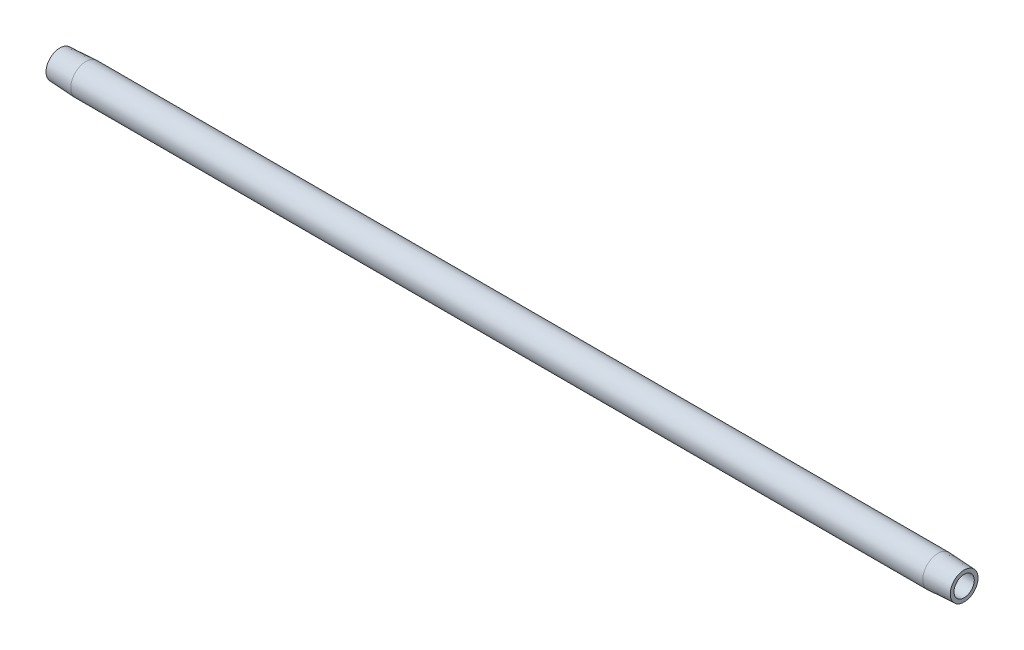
ISO-10303-21;
HEADER;
FILE_DESCRIPTION(('STEP AP214'),'2;1');
FILE_NAME('part.step','',(''),(''),'','','');
FILE_SCHEMA(('AUTOMOTIVE_DESIGN { 1 0 10303 214 1 1 1 1 }'));
ENDSEC;
DATA;
#1=APPLICATION_CONTEXT('core data for automotive mechanical design processes');
#2=APPLICATION_PROTOCOL_DEFINITION('international standard','automotive_design',2000,#1);
#3=PRODUCT_CONTEXT('',#1,'mechanical');
#4=PRODUCT('Part','Part','',(#3));
#5=PRODUCT_RELATED_PRODUCT_CATEGORY('part','',(#4));
#6=PRODUCT_DEFINITION_FORMATION('','',#4);
#7=PRODUCT_DEFINITION_CONTEXT('part definition',#1,'design');
#8=PRODUCT_DEFINITION('design','',#6,#7);
#9=PRODUCT_DEFINITION_SHAPE('','',#8);
#10=(LENGTH_UNIT() NAMED_UNIT(*) SI_UNIT(.MILLI.,.METRE.));
#11=(NAMED_UNIT(*) PLANE_ANGLE_UNIT() SI_UNIT($,.RADIAN.));
#12=(NAMED_UNIT(*) SI_UNIT($,.STERADIAN.) SOLID_ANGLE_UNIT());
#13=UNCERTAINTY_MEASURE_WITH_UNIT(LENGTH_MEASURE(1.E-05),#10,'distance_accuracy_value','');
#14=(GEOMETRIC_REPRESENTATION_CONTEXT(3) GLOBAL_UNCERTAINTY_ASSIGNED_CONTEXT((#13)) GLOBAL_UNIT_ASSIGNED_CONTEXT((#10,
#11,#12)) REPRESENTATION_CONTEXT('',''));
#15=CARTESIAN_POINT('',(0.,0.,0.));
#16=DIRECTION('',(0.,0.,1.));
#17=DIRECTION('',(1.,0.,0.));
#18=AXIS2_PLACEMENT_3D('',#15,#16,#17);
#19=CARTESIAN_POINT('',(0.476141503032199,0.,0.));
#20=DIRECTION('',(-1.,0.,0.));
#21=DIRECTION('',(0.,0.,1.));
#22=AXIS2_PLACEMENT_3D('',#19,#20,#21);
#23=CYLINDRICAL_SURFACE('',#22,5.14349999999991);
#24=CARTESIAN_POINT('',(8.8100393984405,0.,0.));
#25=DIRECTION('',(-1.,0.,0.));
#26=DIRECTION('',(0.,0.,1.));
#27=AXIS2_PLACEMENT_3D('',#24,#25,#26);
#28=CIRCLE('',#27,5.14349999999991);
#29=CARTESIAN_POINT('',(8.8100393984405,0.,5.14349999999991));
#30=VERTEX_POINT('',#29);
#31=EDGE_CURVE('E10',#30,#30,#28,.T.);
#32=ORIENTED_EDGE('',*,*,#31,.F.);
#33=EDGE_LOOP('',(#32));
#34=FACE_BOUND('',#33,.T.);
#35=CARTESIAN_POINT('',(295.989960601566,0.,0.));
#36=DIRECTION('',(-1.,0.,0.));
#37=DIRECTION('',(0.,0.,1.));
#38=AXIS2_PLACEMENT_3D('',#35,#36,#37);
#39=CIRCLE('',#38,5.14349999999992);
#40=CARTESIAN_POINT('',(295.989960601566,0.,5.14349999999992));
#41=VERTEX_POINT('',#40);
#42=EDGE_CURVE('E52',#41,#41,#39,.T.);
#43=ORIENTED_EDGE('',*,*,#42,.T.);
#44=EDGE_LOOP('',(#43));
#45=FACE_BOUND('',#44,.T.);
#46=ADVANCED_FACE('F30',(#34,#45),#23,.T.);
#47=CARTESIAN_POINT('',(8.8100393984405,0.,0.));
#48=DIRECTION('',(1.,0.,0.));
#49=DIRECTION('',(0.,0.,-1.));
#50=AXIS2_PLACEMENT_3D('',#47,#48,#49);
#51=CONICAL_SURFACE('',#50,5.14349999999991,0.0523598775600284);
#52=CARTESIAN_POINT('',(0.,0.,0.));
#53=DIRECTION('',(-1.,0.,0.));
#54=DIRECTION('',(0.,0.,1.));
#55=AXIS2_PLACEMENT_3D('',#52,#53,#54);
#56=CIRCLE('',#55,4.68178539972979);
#57=CARTESIAN_POINT('',(0.,0.,4.68178539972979));
#58=VERTEX_POINT('',#57);
#59=EDGE_CURVE('E36',#58,#58,#56,.T.);
#60=ORIENTED_EDGE('',*,*,#59,.F.);
#61=EDGE_LOOP('',(#60));
#62=FACE_BOUND('',#61,.T.);
#63=ORIENTED_EDGE('',*,*,#31,.T.);
#64=EDGE_LOOP('',(#63));
#65=FACE_BOUND('',#64,.T.);
#66=ADVANCED_FACE('F77',(#62,#65),#51,.T.);
#67=CARTESIAN_POINT('',(0.,4.68178539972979,0.));
#68=DIRECTION('',(1.,0.,0.));
#69=DIRECTION('',(0.,0.,-1.));
#70=AXIS2_PLACEMENT_3D('',#67,#68,#69);
#71=PLANE('',#70);
#72=CARTESIAN_POINT('',(0.,0.,0.));
#73=DIRECTION('',(-1.,0.,0.));
#74=DIRECTION('',(0.,0.,1.));
#75=AXIS2_PLACEMENT_3D('',#72,#73,#74);
#76=CIRCLE('',#75,3.4163);
#77=CARTESIAN_POINT('',(0.,0.,3.4163));
#78=VERTEX_POINT('',#77);
#79=EDGE_CURVE('E40',#78,#78,#76,.T.);
#80=ORIENTED_EDGE('',*,*,#79,.F.);
#81=EDGE_LOOP('',(#80));
#82=FACE_BOUND('',#81,.T.);
#83=ORIENTED_EDGE('',*,*,#59,.T.);
#84=EDGE_LOOP('',(#83));
#85=FACE_BOUND('',#84,.T.);
#86=ADVANCED_FACE('F72',(#82,#85),#71,.F.);
#87=CARTESIAN_POINT('',(0.476141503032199,0.,0.));
#88=DIRECTION('',(-1.,0.,0.));
#89=DIRECTION('',(0.,0.,1.));
#90=AXIS2_PLACEMENT_3D('',#87,#88,#89);
#91=CYLINDRICAL_SURFACE('',#90,3.4163);
#92=CARTESIAN_POINT('',(304.8,0.,0.));
#93=DIRECTION('',(-1.,0.,0.));
#94=DIRECTION('',(0.,0.,1.));
#95=AXIS2_PLACEMENT_3D('',#92,#93,#94);
#96=CIRCLE('',#95,3.41630000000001);
#97=CARTESIAN_POINT('',(304.8,0.,3.41630000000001));
#98=VERTEX_POINT('',#97);
#99=EDGE_CURVE('E44',#98,#98,#96,.T.);
#100=ORIENTED_EDGE('',*,*,#99,.F.);
#101=EDGE_LOOP('',(#100));
#102=FACE_BOUND('',#101,.T.);
#103=ORIENTED_EDGE('',*,*,#79,.T.);
#104=EDGE_LOOP('',(#103));
#105=FACE_BOUND('',#104,.T.);
#106=ADVANCED_FACE('F66',(#102,#105),#91,.F.);
#107=CARTESIAN_POINT('',(304.8,3.41630000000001,0.));
#108=DIRECTION('',(-1.,0.,0.));
#109=DIRECTION('',(0.,0.,1.));
#110=AXIS2_PLACEMENT_3D('',#107,#108,#109);
#111=PLANE('',#110);
#112=CARTESIAN_POINT('',(304.8,0.,0.));
#113=DIRECTION('',(-1.,0.,0.));
#114=DIRECTION('',(0.,0.,1.));
#115=AXIS2_PLACEMENT_3D('',#112,#113,#114);
#116=CIRCLE('',#115,4.68178539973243);
#117=CARTESIAN_POINT('',(304.8,0.,4.68178539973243));
#118=VERTEX_POINT('',#117);
#119=EDGE_CURVE('E49',#118,#118,#116,.T.);
#120=ORIENTED_EDGE('',*,*,#119,.F.);
#121=EDGE_LOOP('',(#120));
#122=FACE_BOUND('',#121,.T.);
#123=ORIENTED_EDGE('',*,*,#99,.T.);
#124=EDGE_LOOP('',(#123));
#125=FACE_BOUND('',#124,.T.);
#126=ADVANCED_FACE('F60',(#122,#125),#111,.F.);
#127=CARTESIAN_POINT('',(304.8,0.,0.));
#128=DIRECTION('',(-1.,0.,0.));
#129=DIRECTION('',(0.,0.,1.));
#130=AXIS2_PLACEMENT_3D('',#127,#128,#129);
#131=CONICAL_SURFACE('',#130,4.68178539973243,0.0523598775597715);
#132=ORIENTED_EDGE('',*,*,#42,.F.);
#133=EDGE_LOOP('',(#132));
#134=FACE_BOUND('',#133,.T.);
#135=ORIENTED_EDGE('',*,*,#119,.T.);
#136=EDGE_LOOP('',(#135));
#137=FACE_BOUND('',#136,.T.);
#138=ADVANCED_FACE('F57',(#134,#137),#131,.T.);
#139=CLOSED_SHELL('',(#46,#66,#86,#106,#126,#138));
#140=MANIFOLD_SOLID_BREP('B2',#139);
#141=ADVANCED_BREP_SHAPE_REPRESENTATION('',(#18,#140),#14);
#142=SHAPE_DEFINITION_REPRESENTATION(#9,#141);
ENDSEC;
END-ISO-10303-21;
